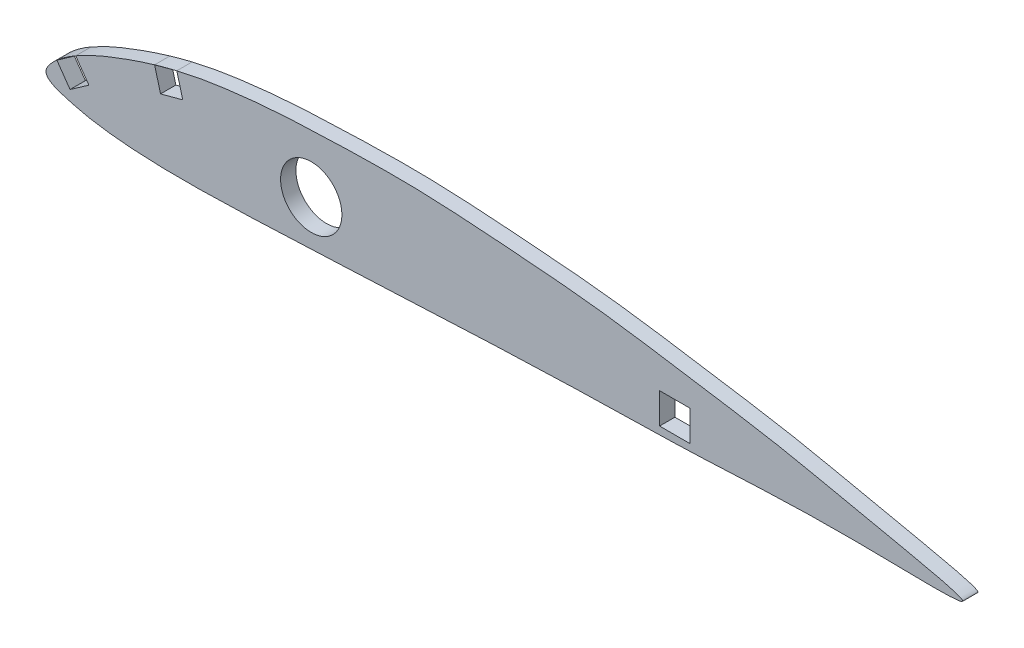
from build123d import *

# Parameters (mm, degrees)
BOSS_EXTRUDE1_DEPTH = 3.175
SKETCH1_R           = 6.35
SKETCH1_W           = 6.35
SKETCH1_H           = 6.35
CUT_EXTRUDE1_DEPTH  = 10


with BuildPart() as part:
    # 3DSketch1 → Boss-Extrude1 (new body)
    with BuildSketch(Plane(origin=(0, 0, 0), x_dir=(0.999981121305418, -0.006144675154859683, 0), z_dir=(0, 0, 1))):
        with BuildLine():
            add(Edge.make_bspline(
                [(0, 0), (-0.058553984, 1.015544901), (2.14569103, 3.309605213), (5.282436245, 5.585456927), (9.352350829, 7.809436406), (17.152715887, 11.038405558), (26.620133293, 14.123250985), (37.837857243, 15.987926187), (47.349045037, 16.996173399), (60.013872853, 17.604936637), (75.862160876, 18.15191909), (94.841805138, 16.936996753), (113.959389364, 15.565486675), (132.65262084, 12.688671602), (152.704501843, 9.749206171), (168.015099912, 6.246453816), (200.598990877, 0), (158.480910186, 1.224427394), (140.179014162, -0.563954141), (100.651753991, -1.430027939), (69.760781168, -3.30368825), (37.953648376, -4.886003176), (22.319529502, -5.238462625), (10.804050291, -4.19453509), (4.936947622, -2.890909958), (0.080351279, -1.393591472), (0, 0)],
                knots=[0, 0, 0, 0, 0.010560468, 0.018211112, 0.032209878, 0.045524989, 0.084069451, 0.108974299, 0.133649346, 0.158232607, 0.207343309, 0.256522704, 0.305826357, 0.355445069, 0.405214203, 0.45539047, 0.506006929, 0.555121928, 0.653369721, 0.702490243, 0.849938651, 0.899083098, 0.948194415, 0.97290595, 0.985508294, 1, 1, 1, 1], degree=3))
        make_face()
    extrude(amount=BOSS_EXTRUDE1_DEPTH)

    # Sketch1 → Cut-Extrude1 (cut)
    with BuildSketch(Plane.XY.offset(3.175)):
        with Locations((54.94, 5)):
            Circle(SKETCH1_R)
        Polygon((2.250700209, 3.215949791), (6.15191182, 5.947607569), (8.883569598, 2.046395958), (4.982357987, -0.68526182), align=None)
        with Locations((130.272, 3.175)):
            Rectangle(SKETCH1_W, SKETCH1_H)
        Polygon((22.493235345, 12.498714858), (27.093457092, 13.73134056), (28.326082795, 9.131118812), (23.725861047, 7.89849311), align=None)
    extrude(amount=-CUT_EXTRUDE1_DEPTH, mode=Mode.SUBTRACT)


solid = part.part
